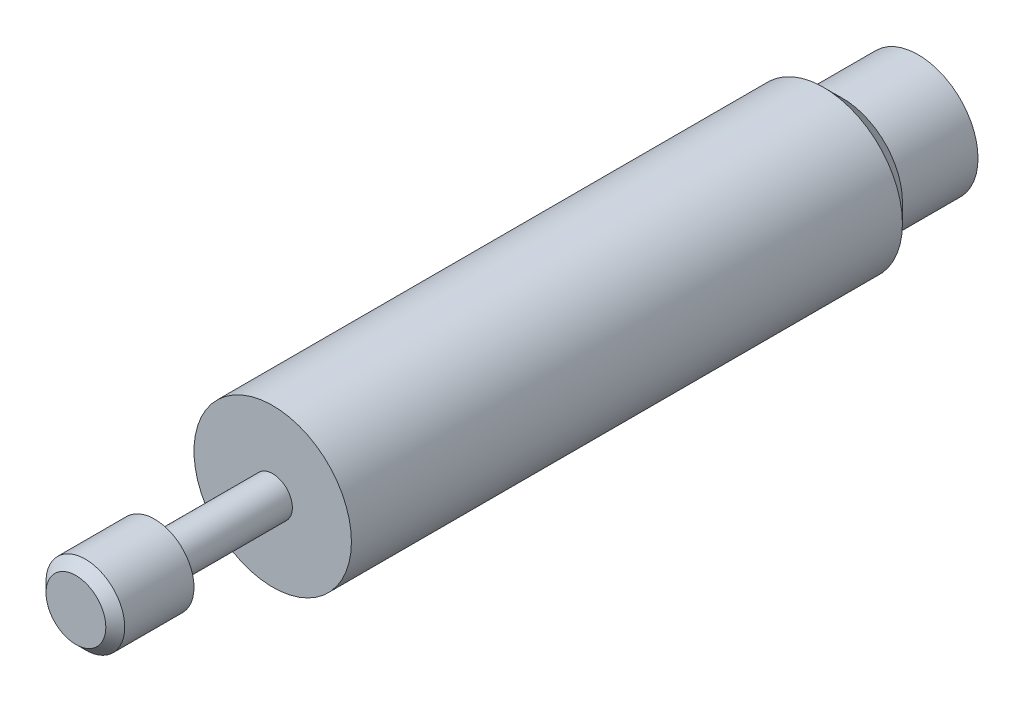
ISO-10303-21;
HEADER;
FILE_DESCRIPTION(('STEP AP214'),'2;1');
FILE_NAME('part.step','',(''),(''),'','','');
FILE_SCHEMA(('AUTOMOTIVE_DESIGN { 1 0 10303 214 1 1 1 1 }'));
ENDSEC;
DATA;
#1=APPLICATION_CONTEXT('core data for automotive mechanical design processes');
#2=APPLICATION_PROTOCOL_DEFINITION('international standard','automotive_design',2000,#1);
#3=PRODUCT_CONTEXT('',#1,'mechanical');
#4=PRODUCT('Part','Part','',(#3));
#5=PRODUCT_RELATED_PRODUCT_CATEGORY('part','',(#4));
#6=PRODUCT_DEFINITION_FORMATION('','',#4);
#7=PRODUCT_DEFINITION_CONTEXT('part definition',#1,'design');
#8=PRODUCT_DEFINITION('design','',#6,#7);
#9=PRODUCT_DEFINITION_SHAPE('','',#8);
#10=(LENGTH_UNIT() NAMED_UNIT(*) SI_UNIT(.MILLI.,.METRE.));
#11=(NAMED_UNIT(*) PLANE_ANGLE_UNIT() SI_UNIT($,.RADIAN.));
#12=(NAMED_UNIT(*) SI_UNIT($,.STERADIAN.) SOLID_ANGLE_UNIT());
#13=UNCERTAINTY_MEASURE_WITH_UNIT(LENGTH_MEASURE(1.E-05),#10,'distance_accuracy_value','');
#14=(GEOMETRIC_REPRESENTATION_CONTEXT(3) GLOBAL_UNCERTAINTY_ASSIGNED_CONTEXT((#13)) GLOBAL_UNIT_ASSIGNED_CONTEXT((#10,
#11,#12)) REPRESENTATION_CONTEXT('',''));
#15=CARTESIAN_POINT('',(0.,0.,0.));
#16=DIRECTION('',(0.,0.,1.));
#17=DIRECTION('',(1.,0.,0.));
#18=AXIS2_PLACEMENT_3D('',#15,#16,#17);
#19=CARTESIAN_POINT('',(0.,0.,22.225));
#20=DIRECTION('',(0.,0.,1.));
#21=DIRECTION('',(1.,0.,0.));
#22=AXIS2_PLACEMENT_3D('',#19,#20,#21);
#23=PLANE('',#22);
#24=CARTESIAN_POINT('',(0.,0.,22.225));
#25=DIRECTION('',(0.,0.,1.));
#26=DIRECTION('',(1.,0.,0.));
#27=AXIS2_PLACEMENT_3D('',#24,#25,#26);
#28=CIRCLE('',#27,6.35);
#29=CARTESIAN_POINT('',(6.35,0.,22.225));
#30=VERTEX_POINT('',#29);
#31=EDGE_CURVE('E46',#30,#30,#28,.T.);
#32=ORIENTED_EDGE('',*,*,#31,.T.);
#33=EDGE_LOOP('',(#32));
#34=FACE_BOUND('',#33,.T.);
#35=CARTESIAN_POINT('',(0.,0.,22.225));
#36=DIRECTION('',(0.,0.,1.));
#37=DIRECTION('',(1.,0.,0.));
#38=AXIS2_PLACEMENT_3D('',#35,#36,#37);
#39=CIRCLE('',#38,1.5875);
#40=CARTESIAN_POINT('',(-1.5875,0.,22.225));
#41=VERTEX_POINT('',#40);
#42=EDGE_CURVE('E58',#41,#41,#39,.T.);
#43=ORIENTED_EDGE('',*,*,#42,.F.);
#44=EDGE_LOOP('',(#43));
#45=FACE_BOUND('',#44,.T.);
#46=ADVANCED_FACE('F31',(#34,#45),#23,.T.);
#47=CARTESIAN_POINT('',(0.,0.,22.225));
#48=DIRECTION('',(0.,0.,-1.));
#49=DIRECTION('',(-1.,0.,0.));
#50=AXIS2_PLACEMENT_3D('',#47,#48,#49);
#51=CYLINDRICAL_SURFACE('',#50,6.35);
#52=ORIENTED_EDGE('',*,*,#31,.F.);
#53=EDGE_LOOP('',(#52));
#54=FACE_BOUND('',#53,.T.);
#55=CARTESIAN_POINT('',(0.,0.,-22.225));
#56=DIRECTION('',(0.,0.,1.));
#57=DIRECTION('',(1.,0.,0.));
#58=AXIS2_PLACEMENT_3D('',#55,#56,#57);
#59=CIRCLE('',#58,6.35);
#60=CARTESIAN_POINT('',(6.35,0.,-22.225));
#61=VERTEX_POINT('',#60);
#62=EDGE_CURVE('E49',#61,#61,#59,.T.);
#63=ORIENTED_EDGE('',*,*,#62,.T.);
#64=EDGE_LOOP('',(#63));
#65=FACE_BOUND('',#64,.T.);
#66=ADVANCED_FACE('F83',(#54,#65),#51,.T.);
#67=CARTESIAN_POINT('',(0.,0.,-29.845));
#68=DIRECTION('',(0.,0.,1.));
#69=DIRECTION('',(1.,0.,0.));
#70=AXIS2_PLACEMENT_3D('',#67,#68,#69);
#71=CYLINDRICAL_SURFACE('',#70,4.826);
#72=CARTESIAN_POINT('',(0.,0.,-23.749));
#73=DIRECTION('',(0.,0.,1.));
#74=DIRECTION('',(1.,0.,0.));
#75=AXIS2_PLACEMENT_3D('',#72,#73,#74);
#76=CIRCLE('',#75,4.826);
#77=CARTESIAN_POINT('',(4.826,0.,-23.749));
#78=VERTEX_POINT('',#77);
#79=EDGE_CURVE('E42',#78,#78,#76,.F.);
#80=CARTESIAN_POINT('',(0.,0.,-29.845));
#81=DIRECTION('',(0.,0.,-1.));
#82=DIRECTION('',(-1.,0.,0.));
#83=AXIS2_PLACEMENT_3D('',#80,#81,#82);
#84=CIRCLE('',#83,4.826);
#85=CARTESIAN_POINT('',(4.826,0.,-29.845));
#86=VERTEX_POINT('',#85);
#87=EDGE_CURVE('E52',#86,#86,#84,.T.);
#88=CARTESIAN_POINT('',(4.826,0.,-23.749));
#89=CARTESIAN_POINT('',(4.826,0.,-23.8125));
#90=CARTESIAN_POINT('',(4.826,0.,-23.876));
#91=CARTESIAN_POINT('',(4.826,0.,-24.003));
#92=CARTESIAN_POINT('',(4.826,0.,-24.0665));
#93=CARTESIAN_POINT('',(4.826,0.,-24.1935));
#94=CARTESIAN_POINT('',(4.826,0.,-24.257));
#95=CARTESIAN_POINT('',(4.826,0.,-24.384));
#96=CARTESIAN_POINT('',(4.826,0.,-24.4475));
#97=CARTESIAN_POINT('',(4.826,0.,-24.5745));
#98=CARTESIAN_POINT('',(4.826,0.,-24.638));
#99=CARTESIAN_POINT('',(4.826,0.,-24.765));
#100=CARTESIAN_POINT('',(4.826,0.,-24.8285));
#101=CARTESIAN_POINT('',(4.826,0.,-24.9555));
#102=CARTESIAN_POINT('',(4.826,0.,-25.019));
#103=CARTESIAN_POINT('',(4.826,0.,-25.146));
#104=CARTESIAN_POINT('',(4.826,0.,-25.2095));
#105=CARTESIAN_POINT('',(4.826,0.,-25.3365));
#106=CARTESIAN_POINT('',(4.826,0.,-25.4));
#107=CARTESIAN_POINT('',(4.826,0.,-25.527));
#108=CARTESIAN_POINT('',(4.826,0.,-25.5905));
#109=CARTESIAN_POINT('',(4.826,0.,-25.7175));
#110=CARTESIAN_POINT('',(4.826,0.,-25.781));
#111=CARTESIAN_POINT('',(4.826,0.,-25.908));
#112=CARTESIAN_POINT('',(4.826,0.,-25.9715));
#113=CARTESIAN_POINT('',(4.826,0.,-26.0985));
#114=CARTESIAN_POINT('',(4.826,0.,-26.162));
#115=CARTESIAN_POINT('',(4.826,0.,-26.289));
#116=CARTESIAN_POINT('',(4.826,0.,-26.3525));
#117=CARTESIAN_POINT('',(4.826,0.,-26.4795));
#118=CARTESIAN_POINT('',(4.826,0.,-26.543));
#119=CARTESIAN_POINT('',(4.826,0.,-26.67));
#120=CARTESIAN_POINT('',(4.826,0.,-26.7335));
#121=CARTESIAN_POINT('',(4.826,0.,-26.8605));
#122=CARTESIAN_POINT('',(4.826,0.,-26.924));
#123=CARTESIAN_POINT('',(4.826,0.,-27.051));
#124=CARTESIAN_POINT('',(4.826,0.,-27.1145));
#125=CARTESIAN_POINT('',(4.826,0.,-27.2415));
#126=CARTESIAN_POINT('',(4.826,0.,-27.305));
#127=CARTESIAN_POINT('',(4.826,0.,-27.432));
#128=CARTESIAN_POINT('',(4.826,0.,-27.4955));
#129=CARTESIAN_POINT('',(4.826,0.,-27.6225));
#130=CARTESIAN_POINT('',(4.826,0.,-27.686));
#131=CARTESIAN_POINT('',(4.826,0.,-27.813));
#132=CARTESIAN_POINT('',(4.826,0.,-27.8765));
#133=CARTESIAN_POINT('',(4.826,0.,-28.0035));
#134=CARTESIAN_POINT('',(4.826,0.,-28.067));
#135=CARTESIAN_POINT('',(4.826,0.,-28.194));
#136=CARTESIAN_POINT('',(4.826,0.,-28.2575));
#137=CARTESIAN_POINT('',(4.826,0.,-28.3845));
#138=CARTESIAN_POINT('',(4.826,0.,-28.448));
#139=CARTESIAN_POINT('',(4.826,0.,-28.575));
#140=CARTESIAN_POINT('',(4.826,0.,-28.6385));
#141=CARTESIAN_POINT('',(4.826,0.,-28.7655));
#142=CARTESIAN_POINT('',(4.826,0.,-28.829));
#143=CARTESIAN_POINT('',(4.826,0.,-28.956));
#144=CARTESIAN_POINT('',(4.826,0.,-29.0195));
#145=CARTESIAN_POINT('',(4.826,0.,-29.1465));
#146=CARTESIAN_POINT('',(4.826,0.,-29.21));
#147=CARTESIAN_POINT('',(4.826,0.,-29.337));
#148=CARTESIAN_POINT('',(4.826,0.,-29.4005));
#149=CARTESIAN_POINT('',(4.826,0.,-29.5275));
#150=CARTESIAN_POINT('',(4.826,0.,-29.591));
#151=CARTESIAN_POINT('',(4.826,0.,-29.718));
#152=CARTESIAN_POINT('',(4.826,0.,-29.7815));
#153=CARTESIAN_POINT('',(4.826,0.,-29.845));
#154=B_SPLINE_CURVE_WITH_KNOTS('',3,(#88,#89,#90,#91,#92,#93,#94,#95,#96,#97,#98,#99,#100,#101,
#102,#103,#104,#105,#106,#107,#108,#109,#110,#111,#112,#113,#114,#115,#116,#117,#118,#119,#120,
#121,#122,#123,#124,#125,#126,#127,#128,#129,#130,#131,#132,#133,#134,#135,#136,#137,#138,#139,
#140,#141,#142,#143,#144,#145,#146,#147,#148,#149,#150,#151,#152,#153),.UNSPECIFIED.,.F.,.F.,(4,
2,2,2,2,2,2,2,2,2,2,2,2,2,2,2,2,2,2,2,2,2,2,2,2,2,2,2,2,2,2,2,4),(0.,0.1905,0.380999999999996,
0.571499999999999,0.761999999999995,0.952499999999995,1.14299999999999,1.33349999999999,
1.52399999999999,1.71449999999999,1.90499999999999,2.09549999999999,2.28599999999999,
2.47649999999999,2.66699999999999,2.85749999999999,3.04799999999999,3.23849999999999,
3.42899999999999,3.61949999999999,3.80999999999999,4.00049999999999,4.19099999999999,
4.38149999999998,4.57199999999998,4.76249999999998,4.95299999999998,5.14349999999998,
5.33399999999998,5.52449999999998,5.71499999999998,5.90549999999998,6.09599999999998),.UNSPECIFIED.);
#155=EDGE_CURVE('BSEAM89',#78,#86,#154,.T.);
#156=ORIENTED_EDGE('',*,*,#79,.T.);
#157=ORIENTED_EDGE('',*,*,#87,.F.);
#158=ORIENTED_EDGE('',*,*,#155,.T.);
#159=ORIENTED_EDGE('',*,*,#155,.F.);
#160=EDGE_LOOP('',(#156,#158,#157,#159));
#161=FACE_BOUND('',#160,.T.);
#162=ADVANCED_FACE('F89',(#161),#71,.T.);
#163=CARTESIAN_POINT('',(0.,0.,-29.845));
#164=DIRECTION('',(0.,0.,-1.));
#165=DIRECTION('',(-1.,0.,0.));
#166=AXIS2_PLACEMENT_3D('',#163,#164,#165);
#167=PLANE('',#166);
#168=ORIENTED_EDGE('',*,*,#87,.T.);
#169=EDGE_LOOP('',(#168));
#170=FACE_BOUND('',#169,.T.);
#171=ADVANCED_FACE('F95',(#170),#167,.T.);
#172=CARTESIAN_POINT('',(0.,0.,-23.749));
#173=DIRECTION('',(0.,0.,1.));
#174=DIRECTION('',(1.,0.,0.));
#175=AXIS2_PLACEMENT_3D('',#172,#173,#174);
#176=CONICAL_SURFACE('',#175,4.826,0.785398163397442);
#177=ORIENTED_EDGE('',*,*,#62,.F.);
#178=EDGE_LOOP('',(#177));
#179=FACE_BOUND('',#178,.T.);
#180=ORIENTED_EDGE('',*,*,#79,.F.);
#181=EDGE_LOOP('',(#180));
#182=FACE_BOUND('',#181,.T.);
#183=ADVANCED_FACE('F78',(#179,#182),#176,.T.);
#184=CARTESIAN_POINT('',(0.,0.,31.75));
#185=DIRECTION('',(0.,0.,-1.));
#186=DIRECTION('',(-1.,0.,0.));
#187=AXIS2_PLACEMENT_3D('',#184,#185,#186);
#188=CYLINDRICAL_SURFACE('',#187,1.5875);
#189=CARTESIAN_POINT('',(0.,0.,31.75));
#190=DIRECTION('',(0.,0.,1.));
#191=DIRECTION('',(1.,0.,0.));
#192=AXIS2_PLACEMENT_3D('',#189,#190,#191);
#193=CIRCLE('',#192,1.5875);
#194=CARTESIAN_POINT('',(-1.5875,0.,31.75));
#195=VERTEX_POINT('',#194);
#196=EDGE_CURVE('E57',#195,#195,#193,.T.);
#197=CARTESIAN_POINT('',(-1.5875,0.,31.75));
#198=CARTESIAN_POINT('',(-1.5875,0.,31.65078125));
#199=CARTESIAN_POINT('',(-1.5875,0.,31.5515625));
#200=CARTESIAN_POINT('',(-1.5875,0.,31.353125));
#201=CARTESIAN_POINT('',(-1.5875,0.,31.25390625));
#202=CARTESIAN_POINT('',(-1.5875,0.,31.05546875));
#203=CARTESIAN_POINT('',(-1.5875,0.,30.95625));
#204=CARTESIAN_POINT('',(-1.5875,0.,30.7578125));
#205=CARTESIAN_POINT('',(-1.5875,0.,30.65859375));
#206=CARTESIAN_POINT('',(-1.5875,0.,30.46015625));
#207=CARTESIAN_POINT('',(-1.5875,0.,30.3609375));
#208=CARTESIAN_POINT('',(-1.5875,0.,30.1625));
#209=CARTESIAN_POINT('',(-1.5875,0.,30.06328125));
#210=CARTESIAN_POINT('',(-1.5875,0.,29.86484375));
#211=CARTESIAN_POINT('',(-1.5875,0.,29.765625));
#212=CARTESIAN_POINT('',(-1.5875,0.,29.5671875));
#213=CARTESIAN_POINT('',(-1.5875,0.,29.46796875));
#214=CARTESIAN_POINT('',(-1.5875,0.,29.26953125));
#215=CARTESIAN_POINT('',(-1.5875,0.,29.1703125));
#216=CARTESIAN_POINT('',(-1.5875,0.,28.971875));
#217=CARTESIAN_POINT('',(-1.5875,0.,28.87265625));
#218=CARTESIAN_POINT('',(-1.5875,0.,28.67421875));
#219=CARTESIAN_POINT('',(-1.5875,0.,28.575));
#220=CARTESIAN_POINT('',(-1.5875,0.,28.3765625));
#221=CARTESIAN_POINT('',(-1.5875,0.,28.27734375));
#222=CARTESIAN_POINT('',(-1.5875,0.,28.07890625));
#223=CARTESIAN_POINT('',(-1.5875,0.,27.9796875));
#224=CARTESIAN_POINT('',(-1.5875,0.,27.78125));
#225=CARTESIAN_POINT('',(-1.5875,0.,27.68203125));
#226=CARTESIAN_POINT('',(-1.5875,0.,27.48359375));
#227=CARTESIAN_POINT('',(-1.5875,0.,27.384375));
#228=CARTESIAN_POINT('',(-1.5875,0.,27.1859375));
#229=CARTESIAN_POINT('',(-1.5875,0.,27.08671875));
#230=CARTESIAN_POINT('',(-1.5875,0.,26.88828125));
#231=CARTESIAN_POINT('',(-1.5875,0.,26.7890625));
#232=CARTESIAN_POINT('',(-1.5875,0.,26.590625));
#233=CARTESIAN_POINT('',(-1.5875,0.,26.49140625));
#234=CARTESIAN_POINT('',(-1.5875,0.,26.29296875));
#235=CARTESIAN_POINT('',(-1.5875,0.,26.19375));
#236=CARTESIAN_POINT('',(-1.5875,0.,25.9953125));
#237=CARTESIAN_POINT('',(-1.5875,0.,25.89609375));
#238=CARTESIAN_POINT('',(-1.5875,0.,25.69765625));
#239=CARTESIAN_POINT('',(-1.5875,0.,25.5984375));
#240=CARTESIAN_POINT('',(-1.5875,0.,25.4));
#241=CARTESIAN_POINT('',(-1.5875,0.,25.30078125));
#242=CARTESIAN_POINT('',(-1.5875,0.,25.10234375));
#243=CARTESIAN_POINT('',(-1.5875,0.,25.003125));
#244=CARTESIAN_POINT('',(-1.5875,0.,24.8046875));
#245=CARTESIAN_POINT('',(-1.5875,0.,24.70546875));
#246=CARTESIAN_POINT('',(-1.5875,0.,24.50703125));
#247=CARTESIAN_POINT('',(-1.5875,0.,24.4078125));
#248=CARTESIAN_POINT('',(-1.5875,0.,24.209375));
#249=CARTESIAN_POINT('',(-1.5875,0.,24.11015625));
#250=CARTESIAN_POINT('',(-1.5875,0.,23.91171875));
#251=CARTESIAN_POINT('',(-1.5875,0.,23.8125));
#252=CARTESIAN_POINT('',(-1.5875,0.,23.6140625));
#253=CARTESIAN_POINT('',(-1.5875,0.,23.51484375));
#254=CARTESIAN_POINT('',(-1.5875,0.,23.31640625));
#255=CARTESIAN_POINT('',(-1.5875,0.,23.2171875));
#256=CARTESIAN_POINT('',(-1.5875,0.,23.01875));
#257=CARTESIAN_POINT('',(-1.5875,0.,22.91953125));
#258=CARTESIAN_POINT('',(-1.5875,0.,22.72109375));
#259=CARTESIAN_POINT('',(-1.5875,0.,22.621875));
#260=CARTESIAN_POINT('',(-1.5875,0.,22.4234375));
#261=CARTESIAN_POINT('',(-1.5875,0.,22.32421875));
#262=CARTESIAN_POINT('',(-1.5875,0.,22.225));
#263=B_SPLINE_CURVE_WITH_KNOTS('',3,(#197,#198,#199,#200,#201,#202,#203,#204,#205,#206,#207,
#208,#209,#210,#211,#212,#213,#214,#215,#216,#217,#218,#219,#220,#221,#222,#223,#224,#225,#226,
#227,#228,#229,#230,#231,#232,#233,#234,#235,#236,#237,#238,#239,#240,#241,#242,#243,#244,#245,
#246,#247,#248,#249,#250,#251,#252,#253,#254,#255,#256,#257,#258,#259,#260,#261,#262),
.UNSPECIFIED.,.F.,.F.,(4,2,2,2,2,2,2,2,2,2,2,2,2,2,2,2,2,2,2,2,2,2,2,2,2,2,2,2,2,2,2,2,4),(0.,
0.29765625,0.595312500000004,0.892968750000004,1.190625,1.48828125,1.7859375,2.08359375,2.38125,
2.67890625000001,2.97656250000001,3.27421875,3.571875,3.86953125,4.1671875,4.46484375,4.7625,
5.06015625,5.3578125,5.65546875,5.953125,6.25078125,6.5484375,6.84609375,7.14375,7.44140625,
7.7390625,8.03671875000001,8.334375,8.63203125,8.92968750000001,9.22734375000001,
9.52500000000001),.UNSPECIFIED.);
#264=EDGE_CURVE('BSEAM72',#195,#41,#263,.T.);
#265=ORIENTED_EDGE('',*,*,#196,.F.);
#266=ORIENTED_EDGE('',*,*,#42,.T.);
#267=ORIENTED_EDGE('',*,*,#264,.T.);
#268=ORIENTED_EDGE('',*,*,#264,.F.);
#269=EDGE_LOOP('',(#265,#267,#266,#268));
#270=FACE_BOUND('',#269,.T.);
#271=ADVANCED_FACE('F72',(#270),#188,.T.);
#272=CARTESIAN_POINT('',(0.,0.,31.75));
#273=DIRECTION('',(0.,0.,1.));
#274=DIRECTION('',(1.,0.,0.));
#275=AXIS2_PLACEMENT_3D('',#272,#273,#274);
#276=PLANE('',#275);
#277=CARTESIAN_POINT('',(0.,0.,31.75));
#278=DIRECTION('',(0.,0.,1.));
#279=DIRECTION('',(1.,0.,0.));
#280=AXIS2_PLACEMENT_3D('',#277,#278,#279);
#281=CIRCLE('',#280,3.175);
#282=CARTESIAN_POINT('',(3.175,0.,31.75));
#283=VERTEX_POINT('',#282);
#284=EDGE_CURVE('E61',#283,#283,#281,.T.);
#285=ORIENTED_EDGE('',*,*,#284,.F.);
#286=EDGE_LOOP('',(#285));
#287=FACE_BOUND('',#286,.T.);
#288=ORIENTED_EDGE('',*,*,#196,.T.);
#289=EDGE_LOOP('',(#288));
#290=FACE_BOUND('',#289,.T.);
#291=ADVANCED_FACE('F69',(#287,#290),#276,.F.);
#292=CARTESIAN_POINT('',(0.,0.,38.1));
#293=DIRECTION('',(0.,0.,-1.));
#294=DIRECTION('',(-1.,0.,0.));
#295=AXIS2_PLACEMENT_3D('',#292,#293,#294);
#296=CYLINDRICAL_SURFACE('',#295,3.175);
#297=CARTESIAN_POINT('',(0.,0.,37.338));
#298=DIRECTION('',(0.,0.,1.));
#299=DIRECTION('',(1.,0.,0.));
#300=AXIS2_PLACEMENT_3D('',#297,#298,#299);
#301=CIRCLE('',#300,3.175);
#302=CARTESIAN_POINT('',(3.175,0.,37.338));
#303=VERTEX_POINT('',#302);
#304=EDGE_CURVE('E10',#303,#303,#301,.F.);
#305=ORIENTED_EDGE('',*,*,#304,.T.);
#306=EDGE_LOOP('',(#305));
#307=FACE_BOUND('',#306,.T.);
#308=ORIENTED_EDGE('',*,*,#284,.T.);
#309=EDGE_LOOP('',(#308));
#310=FACE_BOUND('',#309,.T.);
#311=ADVANCED_FACE('F67',(#307,#310),#296,.T.);
#312=CARTESIAN_POINT('',(0.,0.,38.1));
#313=DIRECTION('',(0.,0.,1.));
#314=DIRECTION('',(1.,0.,0.));
#315=AXIS2_PLACEMENT_3D('',#312,#313,#314);
#316=PLANE('',#315);
#317=CARTESIAN_POINT('',(0.,0.,38.1));
#318=DIRECTION('',(0.,0.,1.));
#319=DIRECTION('',(1.,0.,0.));
#320=AXIS2_PLACEMENT_3D('',#317,#318,#319);
#321=CIRCLE('',#320,2.413);
#322=CARTESIAN_POINT('',(2.413,0.,38.1));
#323=VERTEX_POINT('',#322);
#324=EDGE_CURVE('E38',#323,#323,#321,.T.);
#325=ORIENTED_EDGE('',*,*,#324,.T.);
#326=EDGE_LOOP('',(#325));
#327=FACE_BOUND('',#326,.T.);
#328=ADVANCED_FACE('F150',(#327),#316,.T.);
#329=CARTESIAN_POINT('',(0.,0.,38.1));
#330=DIRECTION('',(0.,0.,-1.));
#331=DIRECTION('',(-1.,0.,0.));
#332=AXIS2_PLACEMENT_3D('',#329,#330,#331);
#333=CONICAL_SURFACE('',#332,2.413,0.785398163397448);
#334=ORIENTED_EDGE('',*,*,#304,.F.);
#335=EDGE_LOOP('',(#334));
#336=FACE_BOUND('',#335,.T.);
#337=ORIENTED_EDGE('',*,*,#324,.F.);
#338=EDGE_LOOP('',(#337));
#339=FACE_BOUND('',#338,.T.);
#340=ADVANCED_FACE('F33',(#336,#339),#333,.T.);
#341=CLOSED_SHELL('',(#46,#66,#162,#171,#183,#271,#291,#311,#328,#340));
#342=MANIFOLD_SOLID_BREP('B2',#341);
#343=ADVANCED_BREP_SHAPE_REPRESENTATION('',(#18,#342),#14);
#344=SHAPE_DEFINITION_REPRESENTATION(#9,#343);
ENDSEC;
END-ISO-10303-21;
